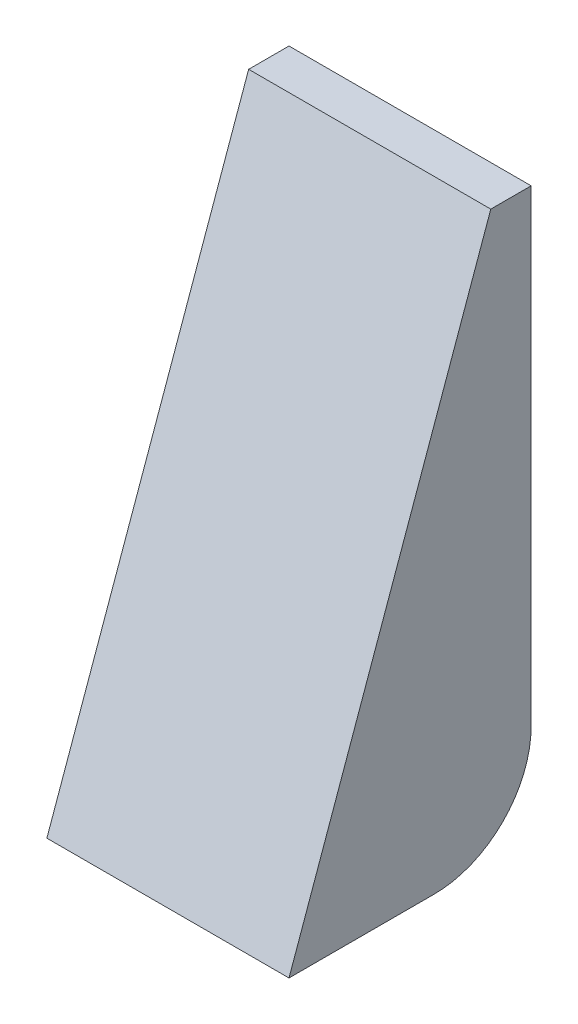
from build123d import *

# Parameters (mm, degrees)
SKETCH4_W           = 15
SKETCH4_H           = 35
BOSS_EXTRUDE2_DEPTH = 15
SKETCH5_W           = 15
SKETCH5_H           = 37.165171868
CUT_EXTRUDE3_DEPTH  = 37.290058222
FILLET1_R           = 6


with BuildPart() as part:
    # Sketch4 → Boss-Extrude2 (new body)
    with BuildSketch(Plane.XY):
        with Locations((7.5, 17.5)):
            Rectangle(SKETCH4_W, SKETCH4_H)
    extrude(amount=BOSS_EXTRUDE2_DEPTH)

    # Sketch5 → Cut-Extrude3 (cut, through all)
    with BuildSketch(Plane(origin=(0, 4.751131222, 13.303167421), x_dir=(-1, 0, 0), z_dir=(0, -0.33633639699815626, -0.9417419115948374))):
        with Locations((-7.5, 13.537539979)):
            Rectangle(SKETCH5_W, SKETCH5_H)
    extrude(amount=-CUT_EXTRUDE3_DEPTH, mode=Mode.SUBTRACT)

    # Fillet1
    fillet1_edges = [part.edges().sort_by_distance(p)[0] for p in [
        (7.5, 0, 0),
    ]]
    fillet(fillet1_edges, radius=FILLET1_R)


solid = part.part
